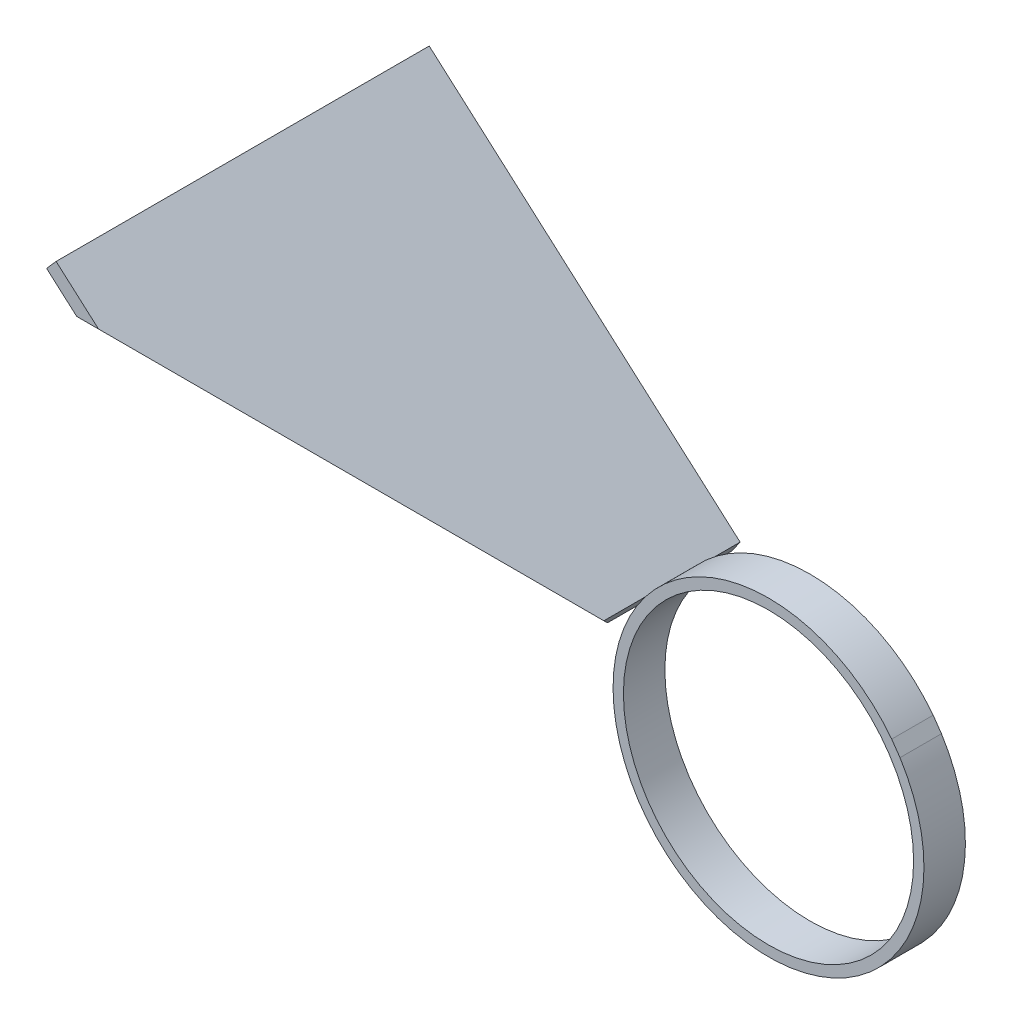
from build123d import *

# Parameters (mm, degrees)
SKETCH1_R           = 37.5
BOSS_EXTRUDE1_DEPTH = 0.01
SKETCH2_R           = 35
CUT_EXTRUDE1_DEPTH  = 10
BOSS_EXTRUDE2_DEPTH = 60
CUT_EXTRUDE2_DEPTH  = 100
SKETCH7_W           = 30
SKETCH7_H           = 75
CUT_EXTRUDE3_DEPTH  = 100
BOSS_EXTRUDE3_START = -10
SKETCH8_R           = 37.5
BOSS_EXTRUDE3_DEPTH = 10
CUT_EXTRUDE4_START  = -3
SKETCH10_R          = 37.5
CUT_EXTRUDE4_DEPTH  = 3
SKETCH11_R          = 35
CUT_EXTRUDE5_DEPTH  = 155.541155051
CUT_EXTRUDE6_DEPTH  = 155.541155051
CUT_EXTRUDE7_DEPTH  = 155.541155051


with BuildPart() as part:
    # Sketch1 → Boss-Extrude1 (new body)
    with BuildSketch(Plane.XY):
        with Locations(Location((0, 0, 0), (0, 0, 180))):
            Circle(SKETCH1_R)
    extrude(amount=BOSS_EXTRUDE1_DEPTH)

    # Sketch2 → Cut-Extrude1 (cut)
    with BuildSketch(Plane.XY.offset(0.01)):
        Circle(SKETCH2_R)
    extrude(amount=-CUT_EXTRUDE1_DEPTH, mode=Mode.SUBTRACT)

    # Sketch5 → Boss-Extrude2 (add, symmetric)
    with BuildSketch(Plane.XY.offset(0.01)):
        Polygon((29.718646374, 22.870331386), (104.718646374, 89.014114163), (107.018779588, 86.406008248), (31.721443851, 20), align=None)
    boss_extrude2 = extrude(amount=BOSS_EXTRUDE2_DEPTH, both=True)

    # Sketch6 → Cut-Extrude2 (cut)
    with BuildSketch(Plane(origin=(107.018779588, 0, 0), x_dir=(0, 0, -1), z_dir=(1, 0, 0))):
        Polygon((-0.01, 20), (-60.01, 80), (-60.01, 20), align=None)
    cut_extrude2 = extrude(amount=-CUT_EXTRUDE2_DEPTH, mode=Mode.SUBTRACT)

    # Sketch7 → Cut-Extrude3 (cut)
    with BuildSketch(Plane(origin=(107.018779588, 0, 0), x_dir=(0, 0, -1), z_dir=(1, 0, 0))):
        with Locations((44.99, 57.5)):
            Rectangle(SKETCH7_W, SKETCH7_H)
    cut_extrude3 = extrude(amount=-CUT_EXTRUDE3_DEPTH, mode=Mode.SUBTRACT)

    # Sketch8 → Boss-Extrude3 (add)
    with BuildSketch(Plane.XY.offset(-7.12).offset(BOSS_EXTRUDE3_START)):
        Circle(SKETCH8_R)
    extrude(amount=BOSS_EXTRUDE3_DEPTH)

    # Sketch10 → Cut-Extrude4 (cut)
    with BuildSketch(Plane.XY.offset(0.01).offset(CUT_EXTRUDE4_START)):
        Circle(SKETCH10_R)
    extrude(amount=CUT_EXTRUDE4_DEPTH, mode=Mode.SUBTRACT)

    # Sketch11 → Cut-Extrude5 (cut, through all)
    with BuildSketch(Plane.XY.offset(-7.12)):
        Circle(SKETCH11_R)
    extrude(amount=-CUT_EXTRUDE5_DEPTH, mode=Mode.SUBTRACT)

    # Mirror2: Boss-Extrude2, Cut-Extrude2, Cut-Extrude3 across plane
    add(boss_extrude2.mirror(Plane(origin=(0, 0, 0), x_dir=(0, 0, 1), z_dir=(1, 0, 0))))
    add(cut_extrude2.mirror(Plane(origin=(0, 0, 0), x_dir=(0, 0, 1), z_dir=(1, 0, 0))), mode=Mode.SUBTRACT)
    add(cut_extrude3.mirror(Plane(origin=(0, 0, 0), x_dir=(0, 0, 1), z_dir=(1, 0, 0))), mode=Mode.SUBTRACT)

    # Sketch12 → Cut-Extrude6 (cut, through all)
    with BuildSketch(Plane.XY.offset(-7.12)):
        Polygon((31.721443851, 20), (29.718646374, 22.870331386), (24.123987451, 51.844596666), (102.325223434, 101.213226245), (122.644716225, 72.47056589), (133.45089112, 16.506300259), (47.966158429, 0), align=None)
    extrude(amount=CUT_EXTRUDE6_DEPTH, mode=Mode.SUBTRACT)

    # Sketch13 → Cut-Extrude7 (cut, through all)
    with BuildSketch(Plane.XY.offset(-7.12)):
        Polygon((31.721443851, 20), (29.718646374, 22.870331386), (104.718646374, 89.014114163), (107.018779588, 86.406008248), align=None)
    extrude(amount=-CUT_EXTRUDE7_DEPTH, mode=Mode.SUBTRACT)


solid = part.part
